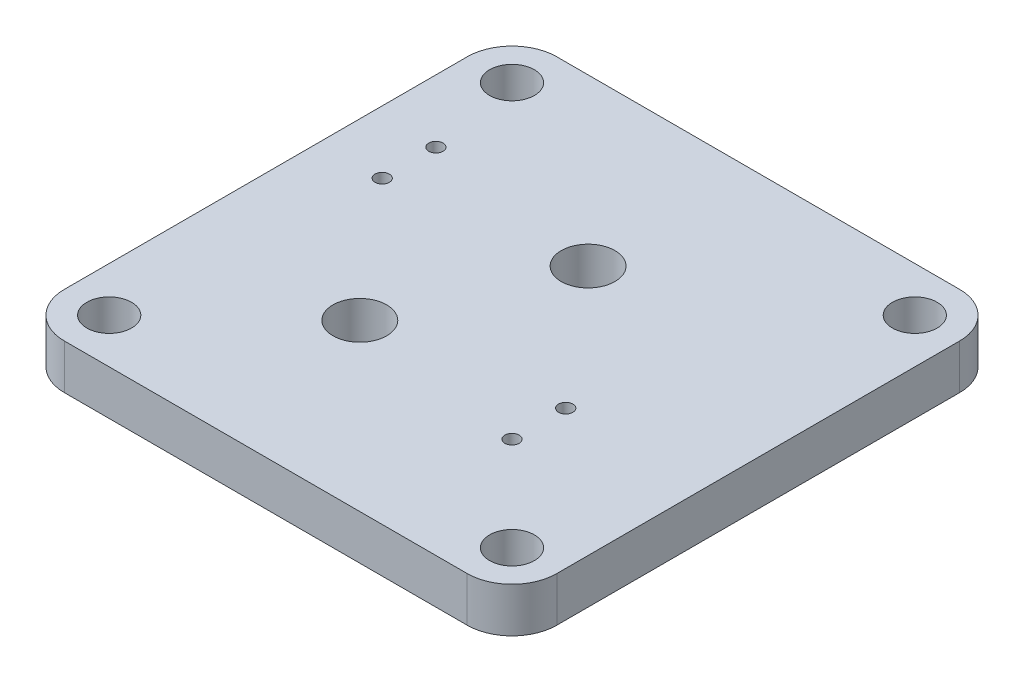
ISO-10303-21;
HEADER;
FILE_DESCRIPTION(('STEP AP214'),'2;1');
FILE_NAME('part.step','',(''),(''),'','','');
FILE_SCHEMA(('AUTOMOTIVE_DESIGN { 1 0 10303 214 1 1 1 1 }'));
ENDSEC;
DATA;
#1=APPLICATION_CONTEXT('core data for automotive mechanical design processes');
#2=APPLICATION_PROTOCOL_DEFINITION('international standard','automotive_design',2000,#1);
#3=PRODUCT_CONTEXT('',#1,'mechanical');
#4=PRODUCT('Part','Part','',(#3));
#5=PRODUCT_RELATED_PRODUCT_CATEGORY('part','',(#4));
#6=PRODUCT_DEFINITION_FORMATION('','',#4);
#7=PRODUCT_DEFINITION_CONTEXT('part definition',#1,'design');
#8=PRODUCT_DEFINITION('design','',#6,#7);
#9=PRODUCT_DEFINITION_SHAPE('','',#8);
#10=(LENGTH_UNIT() NAMED_UNIT(*) SI_UNIT(.MILLI.,.METRE.));
#11=(NAMED_UNIT(*) PLANE_ANGLE_UNIT() SI_UNIT($,.RADIAN.));
#12=(NAMED_UNIT(*) SI_UNIT($,.STERADIAN.) SOLID_ANGLE_UNIT());
#13=UNCERTAINTY_MEASURE_WITH_UNIT(LENGTH_MEASURE(1.E-05),#10,'distance_accuracy_value','');
#14=(GEOMETRIC_REPRESENTATION_CONTEXT(3) GLOBAL_UNCERTAINTY_ASSIGNED_CONTEXT((#13)) GLOBAL_UNIT_ASSIGNED_CONTEXT((#10,
#11,#12)) REPRESENTATION_CONTEXT('',''));
#15=CARTESIAN_POINT('',(0.,0.,0.));
#16=DIRECTION('',(0.,0.,1.));
#17=DIRECTION('',(1.,0.,0.));
#18=AXIS2_PLACEMENT_3D('',#15,#16,#17);
#19=CARTESIAN_POINT('',(-27.5,5.,-27.5));
#20=DIRECTION('',(1.,0.,0.));
#21=DIRECTION('',(0.,0.,-1.));
#22=AXIS2_PLACEMENT_3D('',#19,#20,#21);
#23=PLANE('',#22);
#24=DIRECTION('',(0.,0.,1.));
#25=VECTOR('',#24,1.);
#26=CARTESIAN_POINT('',(-27.5,5.,-27.5));
#27=LINE('',#26,#25);
#28=CARTESIAN_POINT('',(-27.5,5.,-22.5));
#29=VERTEX_POINT('',#28);
#30=CARTESIAN_POINT('',(-27.5,5.,22.5));
#31=VERTEX_POINT('',#30);
#32=EDGE_CURVE('E113',#29,#31,#27,.T.);
#33=ORIENTED_EDGE('',*,*,#32,.F.);
#34=DIRECTION('',(0.,-1.,0.));
#35=VECTOR('',#34,1.);
#36=CARTESIAN_POINT('',(-27.5,5.,-22.5));
#37=LINE('',#36,#35);
#38=CARTESIAN_POINT('',(-27.5,0.,-22.5));
#39=VERTEX_POINT('',#38);
#40=EDGE_CURVE('E98',#29,#39,#37,.T.);
#41=ORIENTED_EDGE('',*,*,#40,.T.);
#42=DIRECTION('',(0.,0.,1.));
#43=VECTOR('',#42,1.);
#44=CARTESIAN_POINT('',(-27.5,0.,-27.5));
#45=LINE('',#44,#43);
#46=CARTESIAN_POINT('',(-27.5,0.,22.5));
#47=VERTEX_POINT('',#46);
#48=EDGE_CURVE('E110',#39,#47,#45,.T.);
#49=ORIENTED_EDGE('',*,*,#48,.T.);
#50=DIRECTION('',(0.,-1.,0.));
#51=VECTOR('',#50,1.);
#52=CARTESIAN_POINT('',(-27.5,5.,22.5));
#53=LINE('',#52,#51);
#54=EDGE_CURVE('E115',#47,#31,#53,.F.);
#55=ORIENTED_EDGE('',*,*,#54,.T.);
#56=EDGE_LOOP('',(#33,#41,#49,#55));
#57=FACE_BOUND('',#56,.T.);
#58=ADVANCED_FACE('F29',(#57),#23,.F.);
#59=CARTESIAN_POINT('',(-27.5,5.,27.5));
#60=DIRECTION('',(0.,0.,-1.));
#61=DIRECTION('',(-1.,0.,0.));
#62=AXIS2_PLACEMENT_3D('',#59,#60,#61);
#63=PLANE('',#62);
#64=DIRECTION('',(1.,0.,0.));
#65=VECTOR('',#64,1.);
#66=CARTESIAN_POINT('',(-27.5,5.,27.5));
#67=LINE('',#66,#65);
#68=CARTESIAN_POINT('',(-22.5,5.,27.5));
#69=VERTEX_POINT('',#68);
#70=CARTESIAN_POINT('',(22.5,5.,27.5));
#71=VERTEX_POINT('',#70);
#72=EDGE_CURVE('E134',#69,#71,#67,.T.);
#73=ORIENTED_EDGE('',*,*,#72,.F.);
#74=DIRECTION('',(0.,-1.,0.));
#75=VECTOR('',#74,1.);
#76=CARTESIAN_POINT('',(-22.5,5.,27.5));
#77=LINE('',#76,#75);
#78=CARTESIAN_POINT('',(-22.5,0.,27.5));
#79=VERTEX_POINT('',#78);
#80=EDGE_CURVE('E158',#69,#79,#77,.T.);
#81=ORIENTED_EDGE('',*,*,#80,.T.);
#82=DIRECTION('',(1.,0.,0.));
#83=VECTOR('',#82,1.);
#84=CARTESIAN_POINT('',(-27.5,0.,27.5));
#85=LINE('',#84,#83);
#86=CARTESIAN_POINT('',(22.5,0.,27.5));
#87=VERTEX_POINT('',#86);
#88=EDGE_CURVE('E119',#79,#87,#85,.T.);
#89=ORIENTED_EDGE('',*,*,#88,.T.);
#90=DIRECTION('',(0.,-1.,0.));
#91=VECTOR('',#90,1.);
#92=CARTESIAN_POINT('',(22.5,5.,27.5));
#93=LINE('',#92,#91);
#94=EDGE_CURVE('E156',#87,#71,#93,.F.);
#95=ORIENTED_EDGE('',*,*,#94,.T.);
#96=EDGE_LOOP('',(#73,#81,#89,#95));
#97=FACE_BOUND('',#96,.T.);
#98=ADVANCED_FACE('F163',(#97),#63,.F.);
#99=CARTESIAN_POINT('',(27.5,5.,-27.5));
#100=DIRECTION('',(-1.,0.,0.));
#101=DIRECTION('',(0.,0.,1.));
#102=AXIS2_PLACEMENT_3D('',#99,#100,#101);
#103=PLANE('',#102);
#104=DIRECTION('',(0.,0.,-1.));
#105=VECTOR('',#104,1.);
#106=CARTESIAN_POINT('',(27.5,5.,-27.5));
#107=LINE('',#106,#105);
#108=CARTESIAN_POINT('',(27.5,5.,22.5));
#109=VERTEX_POINT('',#108);
#110=CARTESIAN_POINT('',(27.5,5.,-22.5));
#111=VERTEX_POINT('',#110);
#112=EDGE_CURVE('E136',#109,#111,#107,.T.);
#113=ORIENTED_EDGE('',*,*,#112,.F.);
#114=DIRECTION('',(0.,-1.,0.));
#115=VECTOR('',#114,1.);
#116=CARTESIAN_POINT('',(27.5,5.,22.5));
#117=LINE('',#116,#115);
#118=CARTESIAN_POINT('',(27.5,0.,22.5));
#119=VERTEX_POINT('',#118);
#120=EDGE_CURVE('E11',#109,#119,#117,.T.);
#121=ORIENTED_EDGE('',*,*,#120,.T.);
#122=DIRECTION('',(0.,0.,-1.));
#123=VECTOR('',#122,1.);
#124=CARTESIAN_POINT('',(27.5,0.,-27.5));
#125=LINE('',#124,#123);
#126=CARTESIAN_POINT('',(27.5,0.,-22.5));
#127=VERTEX_POINT('',#126);
#128=EDGE_CURVE('E123',#119,#127,#125,.T.);
#129=ORIENTED_EDGE('',*,*,#128,.T.);
#130=DIRECTION('',(0.,-1.,0.));
#131=VECTOR('',#130,1.);
#132=CARTESIAN_POINT('',(27.5,5.,-22.5));
#133=LINE('',#132,#131);
#134=EDGE_CURVE('E36',#127,#111,#133,.F.);
#135=ORIENTED_EDGE('',*,*,#134,.T.);
#136=EDGE_LOOP('',(#113,#121,#129,#135));
#137=FACE_BOUND('',#136,.T.);
#138=ADVANCED_FACE('F171',(#137),#103,.F.);
#139=CARTESIAN_POINT('',(-27.5,5.,-27.5));
#140=DIRECTION('',(0.,0.,1.));
#141=DIRECTION('',(1.,0.,0.));
#142=AXIS2_PLACEMENT_3D('',#139,#140,#141);
#143=PLANE('',#142);
#144=DIRECTION('',(-1.,0.,0.));
#145=VECTOR('',#144,1.);
#146=CARTESIAN_POINT('',(-27.5,0.,-27.5));
#147=LINE('',#146,#145);
#148=CARTESIAN_POINT('',(22.5,0.,-27.5));
#149=VERTEX_POINT('',#148);
#150=CARTESIAN_POINT('',(-22.5,0.,-27.5));
#151=VERTEX_POINT('',#150);
#152=EDGE_CURVE('E131',#149,#151,#147,.T.);
#153=ORIENTED_EDGE('',*,*,#152,.T.);
#154=DIRECTION('',(0.,-1.,0.));
#155=VECTOR('',#154,1.);
#156=CARTESIAN_POINT('',(-22.5,5.,-27.5));
#157=LINE('',#156,#155);
#158=CARTESIAN_POINT('',(-22.5,5.,-27.5));
#159=VERTEX_POINT('',#158);
#160=EDGE_CURVE('E99',#151,#159,#157,.F.);
#161=ORIENTED_EDGE('',*,*,#160,.T.);
#162=DIRECTION('',(-1.,0.,0.));
#163=VECTOR('',#162,1.);
#164=CARTESIAN_POINT('',(-27.5,5.,-27.5));
#165=LINE('',#164,#163);
#166=CARTESIAN_POINT('',(22.5,5.,-27.5));
#167=VERTEX_POINT('',#166);
#168=EDGE_CURVE('E138',#167,#159,#165,.T.);
#169=ORIENTED_EDGE('',*,*,#168,.F.);
#170=DIRECTION('',(0.,-1.,0.));
#171=VECTOR('',#170,1.);
#172=CARTESIAN_POINT('',(22.5,5.,-27.5));
#173=LINE('',#172,#171);
#174=EDGE_CURVE('E104',#167,#149,#173,.T.);
#175=ORIENTED_EDGE('',*,*,#174,.T.);
#176=EDGE_LOOP('',(#153,#161,#169,#175));
#177=FACE_BOUND('',#176,.T.);
#178=ADVANCED_FACE('F179',(#177),#143,.F.);
#179=CARTESIAN_POINT('',(-27.5,5.,27.5));
#180=DIRECTION('',(0.,1.,0.));
#181=DIRECTION('',(0.,0.,1.));
#182=AXIS2_PLACEMENT_3D('',#179,#180,#181);
#183=PLANE('',#182);
#184=CARTESIAN_POINT('',(12.,5.,12.));
#185=DIRECTION('',(0.,1.,0.));
#186=DIRECTION('',(0.,0.,-1.));
#187=AXIS2_PLACEMENT_3D('',#184,#185,#186);
#188=CIRCLE('',#187,0.800000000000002);
#189=CARTESIAN_POINT('',(12.,5.,11.2));
#190=VERTEX_POINT('',#189);
#191=EDGE_CURVE('E287',#190,#190,#188,.T.);
#192=ORIENTED_EDGE('',*,*,#191,.F.);
#193=EDGE_LOOP('',(#192));
#194=FACE_BOUND('',#193,.T.);
#195=CARTESIAN_POINT('',(12.,5.,6.));
#196=DIRECTION('',(0.,1.,0.));
#197=DIRECTION('',(0.,0.,1.));
#198=AXIS2_PLACEMENT_3D('',#195,#196,#197);
#199=CIRCLE('',#198,0.800000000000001);
#200=CARTESIAN_POINT('',(12.,5.,6.8));
#201=VERTEX_POINT('',#200);
#202=EDGE_CURVE('E283',#201,#201,#199,.T.);
#203=ORIENTED_EDGE('',*,*,#202,.F.);
#204=EDGE_LOOP('',(#203));
#205=FACE_BOUND('',#204,.T.);
#206=CARTESIAN_POINT('',(-20.5,5.,-6.));
#207=DIRECTION('',(0.,1.,0.));
#208=DIRECTION('',(0.,0.,-1.));
#209=AXIS2_PLACEMENT_3D('',#206,#207,#208);
#210=CIRCLE('',#209,0.799999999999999);
#211=CARTESIAN_POINT('',(-20.5,5.,-6.8));
#212=VERTEX_POINT('',#211);
#213=EDGE_CURVE('E279',#212,#212,#210,.T.);
#214=ORIENTED_EDGE('',*,*,#213,.F.);
#215=EDGE_LOOP('',(#214));
#216=FACE_BOUND('',#215,.T.);
#217=CARTESIAN_POINT('',(-20.5,5.,-12.));
#218=DIRECTION('',(0.,1.,0.));
#219=DIRECTION('',(0.,0.,1.));
#220=AXIS2_PLACEMENT_3D('',#217,#218,#219);
#221=CIRCLE('',#220,0.799999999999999);
#222=CARTESIAN_POINT('',(-20.5,5.,-11.2));
#223=VERTEX_POINT('',#222);
#224=EDGE_CURVE('E275',#223,#223,#221,.T.);
#225=ORIENTED_EDGE('',*,*,#224,.F.);
#226=EDGE_LOOP('',(#225));
#227=FACE_BOUND('',#226,.T.);
#228=CARTESIAN_POINT('',(-0.5,5.,-9.));
#229=DIRECTION('',(0.,1.,0.));
#230=DIRECTION('',(0.,0.,1.));
#231=AXIS2_PLACEMENT_3D('',#228,#229,#230);
#232=CIRCLE('',#231,3.);
#233=CARTESIAN_POINT('',(-0.5,5.,-6.));
#234=VERTEX_POINT('',#233);
#235=EDGE_CURVE('E271',#234,#234,#232,.T.);
#236=ORIENTED_EDGE('',*,*,#235,.F.);
#237=EDGE_LOOP('',(#236));
#238=FACE_BOUND('',#237,.T.);
#239=CARTESIAN_POINT('',(-8.,5.,9.));
#240=DIRECTION('',(0.,1.,0.));
#241=DIRECTION('',(0.,0.,1.));
#242=AXIS2_PLACEMENT_3D('',#239,#240,#241);
#243=CIRCLE('',#242,3.);
#244=CARTESIAN_POINT('',(-8.,5.,12.));
#245=VERTEX_POINT('',#244);
#246=EDGE_CURVE('E267',#245,#245,#243,.T.);
#247=ORIENTED_EDGE('',*,*,#246,.F.);
#248=EDGE_LOOP('',(#247));
#249=FACE_BOUND('',#248,.T.);
#250=CARTESIAN_POINT('',(-22.5,5.,22.5));
#251=DIRECTION('',(0.,1.,0.));
#252=DIRECTION('',(0.,0.,-1.));
#253=AXIS2_PLACEMENT_3D('',#250,#251,#252);
#254=CIRCLE('',#253,2.5);
#255=CARTESIAN_POINT('',(-22.5,5.,20.));
#256=VERTEX_POINT('',#255);
#257=EDGE_CURVE('E263',#256,#256,#254,.T.);
#258=ORIENTED_EDGE('',*,*,#257,.F.);
#259=EDGE_LOOP('',(#258));
#260=FACE_BOUND('',#259,.T.);
#261=CARTESIAN_POINT('',(22.5,5.,22.5));
#262=DIRECTION('',(0.,1.,0.));
#263=DIRECTION('',(0.,0.,1.));
#264=AXIS2_PLACEMENT_3D('',#261,#262,#263);
#265=CIRCLE('',#264,2.5);
#266=CARTESIAN_POINT('',(22.5,5.,25.));
#267=VERTEX_POINT('',#266);
#268=EDGE_CURVE('E259',#267,#267,#265,.T.);
#269=ORIENTED_EDGE('',*,*,#268,.F.);
#270=EDGE_LOOP('',(#269));
#271=FACE_BOUND('',#270,.T.);
#272=CARTESIAN_POINT('',(22.5,5.,-22.5));
#273=DIRECTION('',(0.,1.,0.));
#274=DIRECTION('',(0.,0.,-1.));
#275=AXIS2_PLACEMENT_3D('',#272,#273,#274);
#276=CIRCLE('',#275,2.5);
#277=CARTESIAN_POINT('',(22.5,5.,-25.));
#278=VERTEX_POINT('',#277);
#279=EDGE_CURVE('E253',#278,#278,#276,.T.);
#280=ORIENTED_EDGE('',*,*,#279,.F.);
#281=EDGE_LOOP('',(#280));
#282=FACE_BOUND('',#281,.T.);
#283=CARTESIAN_POINT('',(-22.5,5.,-22.5));
#284=DIRECTION('',(0.,1.,0.));
#285=DIRECTION('',(0.,0.,1.));
#286=AXIS2_PLACEMENT_3D('',#283,#284,#285);
#287=CIRCLE('',#286,2.5);
#288=CARTESIAN_POINT('',(-22.5,5.,-20.));
#289=VERTEX_POINT('',#288);
#290=EDGE_CURVE('E126',#289,#289,#287,.T.);
#291=ORIENTED_EDGE('',*,*,#290,.F.);
#292=EDGE_LOOP('',(#291));
#293=FACE_BOUND('',#292,.T.);
#294=ORIENTED_EDGE('',*,*,#168,.T.);
#295=CARTESIAN_POINT('',(-22.5,5.,-22.5));
#296=DIRECTION('',(0.,1.,0.));
#297=DIRECTION('',(0.,0.,1.));
#298=AXIS2_PLACEMENT_3D('',#295,#296,#297);
#299=CIRCLE('',#298,5.);
#300=EDGE_CURVE('E154',#159,#29,#299,.T.);
#301=ORIENTED_EDGE('',*,*,#300,.T.);
#302=ORIENTED_EDGE('',*,*,#32,.T.);
#303=CARTESIAN_POINT('',(-22.5,5.,22.5));
#304=DIRECTION('',(0.,1.,0.));
#305=DIRECTION('',(0.,0.,1.));
#306=AXIS2_PLACEMENT_3D('',#303,#304,#305);
#307=CIRCLE('',#306,5.);
#308=EDGE_CURVE('E152',#31,#69,#307,.T.);
#309=ORIENTED_EDGE('',*,*,#308,.T.);
#310=ORIENTED_EDGE('',*,*,#72,.T.);
#311=CARTESIAN_POINT('',(22.5,5.,22.5));
#312=DIRECTION('',(0.,1.,0.));
#313=DIRECTION('',(0.,0.,1.));
#314=AXIS2_PLACEMENT_3D('',#311,#312,#313);
#315=CIRCLE('',#314,5.);
#316=EDGE_CURVE('E49',#71,#109,#315,.T.);
#317=ORIENTED_EDGE('',*,*,#316,.T.);
#318=ORIENTED_EDGE('',*,*,#112,.T.);
#319=CARTESIAN_POINT('',(22.5,5.,-22.5));
#320=DIRECTION('',(0.,1.,0.));
#321=DIRECTION('',(0.,0.,1.));
#322=AXIS2_PLACEMENT_3D('',#319,#320,#321);
#323=CIRCLE('',#322,5.);
#324=EDGE_CURVE('E149',#111,#167,#323,.T.);
#325=ORIENTED_EDGE('',*,*,#324,.T.);
#326=EDGE_LOOP('',(#294,#301,#302,#309,#310,#317,#318,#325));
#327=FACE_BOUND('',#326,.T.);
#328=ADVANCED_FACE('F173',(#194,#205,#216,#227,#238,#249,#260,#271,#282,#293,#327),#183,.T.);
#329=CARTESIAN_POINT('',(-27.5,0.,27.5));
#330=DIRECTION('',(0.,1.,0.));
#331=DIRECTION('',(0.,0.,1.));
#332=AXIS2_PLACEMENT_3D('',#329,#330,#331);
#333=PLANE('',#332);
#334=CARTESIAN_POINT('',(12.,0.,12.));
#335=DIRECTION('',(0.,1.,0.));
#336=DIRECTION('',(0.,0.,-1.));
#337=AXIS2_PLACEMENT_3D('',#334,#335,#336);
#338=CIRCLE('',#337,0.800000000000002);
#339=CARTESIAN_POINT('',(12.,0.,11.2));
#340=VERTEX_POINT('',#339);
#341=EDGE_CURVE('E210',#340,#340,#338,.T.);
#342=ORIENTED_EDGE('',*,*,#341,.T.);
#343=EDGE_LOOP('',(#342));
#344=FACE_BOUND('',#343,.T.);
#345=CARTESIAN_POINT('',(12.,0.,6.));
#346=DIRECTION('',(0.,1.,0.));
#347=DIRECTION('',(0.,0.,1.));
#348=AXIS2_PLACEMENT_3D('',#345,#346,#347);
#349=CIRCLE('',#348,0.800000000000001);
#350=CARTESIAN_POINT('',(12.,0.,6.8));
#351=VERTEX_POINT('',#350);
#352=EDGE_CURVE('E214',#351,#351,#349,.T.);
#353=ORIENTED_EDGE('',*,*,#352,.T.);
#354=EDGE_LOOP('',(#353));
#355=FACE_BOUND('',#354,.T.);
#356=CARTESIAN_POINT('',(-20.5,0.,-6.));
#357=DIRECTION('',(0.,1.,0.));
#358=DIRECTION('',(0.,0.,-1.));
#359=AXIS2_PLACEMENT_3D('',#356,#357,#358);
#360=CIRCLE('',#359,0.799999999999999);
#361=CARTESIAN_POINT('',(-20.5,0.,-6.8));
#362=VERTEX_POINT('',#361);
#363=EDGE_CURVE('E218',#362,#362,#360,.T.);
#364=ORIENTED_EDGE('',*,*,#363,.T.);
#365=EDGE_LOOP('',(#364));
#366=FACE_BOUND('',#365,.T.);
#367=CARTESIAN_POINT('',(-20.5,0.,-12.));
#368=DIRECTION('',(0.,1.,0.));
#369=DIRECTION('',(0.,0.,1.));
#370=AXIS2_PLACEMENT_3D('',#367,#368,#369);
#371=CIRCLE('',#370,0.799999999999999);
#372=CARTESIAN_POINT('',(-20.5,0.,-11.2));
#373=VERTEX_POINT('',#372);
#374=EDGE_CURVE('E222',#373,#373,#371,.T.);
#375=ORIENTED_EDGE('',*,*,#374,.T.);
#376=EDGE_LOOP('',(#375));
#377=FACE_BOUND('',#376,.T.);
#378=CARTESIAN_POINT('',(-0.5,0.,-9.));
#379=DIRECTION('',(0.,1.,0.));
#380=DIRECTION('',(0.,0.,1.));
#381=AXIS2_PLACEMENT_3D('',#378,#379,#380);
#382=CIRCLE('',#381,3.);
#383=CARTESIAN_POINT('',(-0.5,0.,-6.));
#384=VERTEX_POINT('',#383);
#385=EDGE_CURVE('E226',#384,#384,#382,.T.);
#386=ORIENTED_EDGE('',*,*,#385,.T.);
#387=EDGE_LOOP('',(#386));
#388=FACE_BOUND('',#387,.T.);
#389=CARTESIAN_POINT('',(-8.,0.,9.));
#390=DIRECTION('',(0.,1.,0.));
#391=DIRECTION('',(0.,0.,1.));
#392=AXIS2_PLACEMENT_3D('',#389,#390,#391);
#393=CIRCLE('',#392,3.);
#394=CARTESIAN_POINT('',(-8.,0.,12.));
#395=VERTEX_POINT('',#394);
#396=EDGE_CURVE('E230',#395,#395,#393,.T.);
#397=ORIENTED_EDGE('',*,*,#396,.T.);
#398=EDGE_LOOP('',(#397));
#399=FACE_BOUND('',#398,.T.);
#400=CARTESIAN_POINT('',(-22.5,0.,22.5));
#401=DIRECTION('',(0.,1.,0.));
#402=DIRECTION('',(0.,0.,-1.));
#403=AXIS2_PLACEMENT_3D('',#400,#401,#402);
#404=CIRCLE('',#403,2.5);
#405=CARTESIAN_POINT('',(-22.5,0.,20.));
#406=VERTEX_POINT('',#405);
#407=EDGE_CURVE('E234',#406,#406,#404,.T.);
#408=ORIENTED_EDGE('',*,*,#407,.T.);
#409=EDGE_LOOP('',(#408));
#410=FACE_BOUND('',#409,.T.);
#411=CARTESIAN_POINT('',(22.5,0.,22.5));
#412=DIRECTION('',(0.,1.,0.));
#413=DIRECTION('',(0.,0.,1.));
#414=AXIS2_PLACEMENT_3D('',#411,#412,#413);
#415=CIRCLE('',#414,2.5);
#416=CARTESIAN_POINT('',(22.5,0.,25.));
#417=VERTEX_POINT('',#416);
#418=EDGE_CURVE('E238',#417,#417,#415,.T.);
#419=ORIENTED_EDGE('',*,*,#418,.T.);
#420=EDGE_LOOP('',(#419));
#421=FACE_BOUND('',#420,.T.);
#422=CARTESIAN_POINT('',(22.5,0.,-22.5));
#423=DIRECTION('',(0.,1.,0.));
#424=DIRECTION('',(0.,0.,-1.));
#425=AXIS2_PLACEMENT_3D('',#422,#423,#424);
#426=CIRCLE('',#425,2.5);
#427=CARTESIAN_POINT('',(22.5,0.,-25.));
#428=VERTEX_POINT('',#427);
#429=EDGE_CURVE('E242',#428,#428,#426,.T.);
#430=ORIENTED_EDGE('',*,*,#429,.T.);
#431=EDGE_LOOP('',(#430));
#432=FACE_BOUND('',#431,.T.);
#433=CARTESIAN_POINT('',(-22.5,0.,-22.5));
#434=DIRECTION('',(0.,1.,0.));
#435=DIRECTION('',(0.,0.,1.));
#436=AXIS2_PLACEMENT_3D('',#433,#434,#435);
#437=CIRCLE('',#436,2.5);
#438=CARTESIAN_POINT('',(-22.5,0.,-20.));
#439=VERTEX_POINT('',#438);
#440=EDGE_CURVE('E120',#439,#439,#437,.T.);
#441=ORIENTED_EDGE('',*,*,#440,.T.);
#442=EDGE_LOOP('',(#441));
#443=FACE_BOUND('',#442,.T.);
#444=ORIENTED_EDGE('',*,*,#48,.F.);
#445=CARTESIAN_POINT('',(-22.5,0.,-22.5));
#446=DIRECTION('',(0.,1.,0.));
#447=DIRECTION('',(0.,0.,1.));
#448=AXIS2_PLACEMENT_3D('',#445,#446,#447);
#449=CIRCLE('',#448,5.);
#450=EDGE_CURVE('E94',#39,#151,#449,.F.);
#451=ORIENTED_EDGE('',*,*,#450,.T.);
#452=ORIENTED_EDGE('',*,*,#152,.F.);
#453=CARTESIAN_POINT('',(22.5,0.,-22.5));
#454=DIRECTION('',(0.,1.,0.));
#455=DIRECTION('',(0.,0.,1.));
#456=AXIS2_PLACEMENT_3D('',#453,#454,#455);
#457=CIRCLE('',#456,5.);
#458=EDGE_CURVE('E114',#149,#127,#457,.F.);
#459=ORIENTED_EDGE('',*,*,#458,.T.);
#460=ORIENTED_EDGE('',*,*,#128,.F.);
#461=CARTESIAN_POINT('',(22.5,0.,22.5));
#462=DIRECTION('',(0.,1.,0.));
#463=DIRECTION('',(0.,0.,1.));
#464=AXIS2_PLACEMENT_3D('',#461,#462,#463);
#465=CIRCLE('',#464,5.);
#466=EDGE_CURVE('E143',#119,#87,#465,.F.);
#467=ORIENTED_EDGE('',*,*,#466,.T.);
#468=ORIENTED_EDGE('',*,*,#88,.F.);
#469=CARTESIAN_POINT('',(-22.5,0.,22.5));
#470=DIRECTION('',(0.,1.,0.));
#471=DIRECTION('',(0.,0.,1.));
#472=AXIS2_PLACEMENT_3D('',#469,#470,#471);
#473=CIRCLE('',#472,5.);
#474=EDGE_CURVE('E105',#79,#47,#473,.F.);
#475=ORIENTED_EDGE('',*,*,#474,.T.);
#476=EDGE_LOOP('',(#444,#451,#452,#459,#460,#467,#468,#475));
#477=FACE_BOUND('',#476,.T.);
#478=ADVANCED_FACE('F117',(#344,#355,#366,#377,#388,#399,#410,#421,#432,#443,#477),#333,.F.);
#479=CARTESIAN_POINT('',(-22.5,5.,-22.5));
#480=DIRECTION('',(0.,-1.,0.));
#481=DIRECTION('',(0.,0.,-1.));
#482=AXIS2_PLACEMENT_3D('',#479,#480,#481);
#483=CYLINDRICAL_SURFACE('',#482,5.);
#484=ORIENTED_EDGE('',*,*,#300,.F.);
#485=ORIENTED_EDGE('',*,*,#160,.F.);
#486=ORIENTED_EDGE('',*,*,#450,.F.);
#487=ORIENTED_EDGE('',*,*,#40,.F.);
#488=EDGE_LOOP('',(#484,#485,#486,#487));
#489=FACE_BOUND('',#488,.T.);
#490=ADVANCED_FACE('F97',(#489),#483,.T.);
#491=CARTESIAN_POINT('',(-22.5,5.,22.5));
#492=DIRECTION('',(0.,-1.,0.));
#493=DIRECTION('',(0.,0.,-1.));
#494=AXIS2_PLACEMENT_3D('',#491,#492,#493);
#495=CYLINDRICAL_SURFACE('',#494,5.);
#496=ORIENTED_EDGE('',*,*,#308,.F.);
#497=ORIENTED_EDGE('',*,*,#54,.F.);
#498=ORIENTED_EDGE('',*,*,#474,.F.);
#499=ORIENTED_EDGE('',*,*,#80,.F.);
#500=EDGE_LOOP('',(#496,#497,#498,#499));
#501=FACE_BOUND('',#500,.T.);
#502=ADVANCED_FACE('F180',(#501),#495,.T.);
#503=CARTESIAN_POINT('',(22.5,5.,22.5));
#504=DIRECTION('',(0.,-1.,0.));
#505=DIRECTION('',(0.,0.,-1.));
#506=AXIS2_PLACEMENT_3D('',#503,#504,#505);
#507=CYLINDRICAL_SURFACE('',#506,5.);
#508=ORIENTED_EDGE('',*,*,#316,.F.);
#509=ORIENTED_EDGE('',*,*,#94,.F.);
#510=ORIENTED_EDGE('',*,*,#466,.F.);
#511=ORIENTED_EDGE('',*,*,#120,.F.);
#512=EDGE_LOOP('',(#508,#509,#510,#511));
#513=FACE_BOUND('',#512,.T.);
#514=ADVANCED_FACE('F170',(#513),#507,.T.);
#515=CARTESIAN_POINT('',(22.5,5.,-22.5));
#516=DIRECTION('',(0.,-1.,0.));
#517=DIRECTION('',(0.,0.,-1.));
#518=AXIS2_PLACEMENT_3D('',#515,#516,#517);
#519=CYLINDRICAL_SURFACE('',#518,5.);
#520=ORIENTED_EDGE('',*,*,#324,.F.);
#521=ORIENTED_EDGE('',*,*,#134,.F.);
#522=ORIENTED_EDGE('',*,*,#458,.F.);
#523=ORIENTED_EDGE('',*,*,#174,.F.);
#524=EDGE_LOOP('',(#520,#521,#522,#523));
#525=FACE_BOUND('',#524,.T.);
#526=ADVANCED_FACE('F177',(#525),#519,.T.);
#527=CARTESIAN_POINT('',(-22.5,0.,-22.5));
#528=DIRECTION('',(0.,1.,0.));
#529=DIRECTION('',(0.,0.,1.));
#530=AXIS2_PLACEMENT_3D('',#527,#528,#529);
#531=CYLINDRICAL_SURFACE('',#530,2.5);
#532=ORIENTED_EDGE('',*,*,#440,.F.);
#533=EDGE_LOOP('',(#532));
#534=FACE_BOUND('',#533,.T.);
#535=ORIENTED_EDGE('',*,*,#290,.T.);
#536=EDGE_LOOP('',(#535));
#537=FACE_BOUND('',#536,.T.);
#538=ADVANCED_FACE('F245',(#534,#537),#531,.F.);
#539=CARTESIAN_POINT('',(22.5,0.,-22.5));
#540=DIRECTION('',(0.,1.,0.));
#541=DIRECTION('',(0.,0.,1.));
#542=AXIS2_PLACEMENT_3D('',#539,#540,#541);
#543=CYLINDRICAL_SURFACE('',#542,2.5);
#544=ORIENTED_EDGE('',*,*,#429,.F.);
#545=EDGE_LOOP('',(#544));
#546=FACE_BOUND('',#545,.T.);
#547=ORIENTED_EDGE('',*,*,#279,.T.);
#548=EDGE_LOOP('',(#547));
#549=FACE_BOUND('',#548,.T.);
#550=ADVANCED_FACE('F248',(#546,#549),#543,.F.);
#551=CARTESIAN_POINT('',(22.5,0.,22.5));
#552=DIRECTION('',(0.,1.,0.));
#553=DIRECTION('',(0.,0.,1.));
#554=AXIS2_PLACEMENT_3D('',#551,#552,#553);
#555=CYLINDRICAL_SURFACE('',#554,2.5);
#556=ORIENTED_EDGE('',*,*,#418,.F.);
#557=EDGE_LOOP('',(#556));
#558=FACE_BOUND('',#557,.T.);
#559=ORIENTED_EDGE('',*,*,#268,.T.);
#560=EDGE_LOOP('',(#559));
#561=FACE_BOUND('',#560,.T.);
#562=ADVANCED_FACE('F310',(#558,#561),#555,.F.);
#563=CARTESIAN_POINT('',(-22.5,0.,22.5));
#564=DIRECTION('',(0.,1.,0.));
#565=DIRECTION('',(0.,0.,1.));
#566=AXIS2_PLACEMENT_3D('',#563,#564,#565);
#567=CYLINDRICAL_SURFACE('',#566,2.5);
#568=ORIENTED_EDGE('',*,*,#407,.F.);
#569=EDGE_LOOP('',(#568));
#570=FACE_BOUND('',#569,.T.);
#571=ORIENTED_EDGE('',*,*,#257,.T.);
#572=EDGE_LOOP('',(#571));
#573=FACE_BOUND('',#572,.T.);
#574=ADVANCED_FACE('F316',(#570,#573),#567,.F.);
#575=CARTESIAN_POINT('',(-8.,0.,9.));
#576=DIRECTION('',(0.,1.,0.));
#577=DIRECTION('',(0.,0.,1.));
#578=AXIS2_PLACEMENT_3D('',#575,#576,#577);
#579=CYLINDRICAL_SURFACE('',#578,3.);
#580=ORIENTED_EDGE('',*,*,#396,.F.);
#581=EDGE_LOOP('',(#580));
#582=FACE_BOUND('',#581,.T.);
#583=ORIENTED_EDGE('',*,*,#246,.T.);
#584=EDGE_LOOP('',(#583));
#585=FACE_BOUND('',#584,.T.);
#586=ADVANCED_FACE('F349',(#582,#585),#579,.F.);
#587=CARTESIAN_POINT('',(-0.5,0.,-9.));
#588=DIRECTION('',(0.,1.,0.));
#589=DIRECTION('',(0.,0.,1.));
#590=AXIS2_PLACEMENT_3D('',#587,#588,#589);
#591=CYLINDRICAL_SURFACE('',#590,3.);
#592=ORIENTED_EDGE('',*,*,#385,.F.);
#593=EDGE_LOOP('',(#592));
#594=FACE_BOUND('',#593,.T.);
#595=ORIENTED_EDGE('',*,*,#235,.T.);
#596=EDGE_LOOP('',(#595));
#597=FACE_BOUND('',#596,.T.);
#598=ADVANCED_FACE('F370',(#594,#597),#591,.F.);
#599=CARTESIAN_POINT('',(-20.5,0.,-12.));
#600=DIRECTION('',(0.,1.,0.));
#601=DIRECTION('',(0.,0.,1.));
#602=AXIS2_PLACEMENT_3D('',#599,#600,#601);
#603=CYLINDRICAL_SURFACE('',#602,0.799999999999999);
#604=ORIENTED_EDGE('',*,*,#374,.F.);
#605=EDGE_LOOP('',(#604));
#606=FACE_BOUND('',#605,.T.);
#607=ORIENTED_EDGE('',*,*,#224,.T.);
#608=EDGE_LOOP('',(#607));
#609=FACE_BOUND('',#608,.T.);
#610=ADVANCED_FACE('F380',(#606,#609),#603,.F.);
#611=CARTESIAN_POINT('',(-20.5,0.,-6.));
#612=DIRECTION('',(0.,1.,0.));
#613=DIRECTION('',(0.,0.,1.));
#614=AXIS2_PLACEMENT_3D('',#611,#612,#613);
#615=CYLINDRICAL_SURFACE('',#614,0.799999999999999);
#616=ORIENTED_EDGE('',*,*,#363,.F.);
#617=EDGE_LOOP('',(#616));
#618=FACE_BOUND('',#617,.T.);
#619=ORIENTED_EDGE('',*,*,#213,.T.);
#620=EDGE_LOOP('',(#619));
#621=FACE_BOUND('',#620,.T.);
#622=ADVANCED_FACE('F390',(#618,#621),#615,.F.);
#623=CARTESIAN_POINT('',(12.,0.,6.));
#624=DIRECTION('',(0.,1.,0.));
#625=DIRECTION('',(0.,0.,1.));
#626=AXIS2_PLACEMENT_3D('',#623,#624,#625);
#627=CYLINDRICAL_SURFACE('',#626,0.800000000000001);
#628=ORIENTED_EDGE('',*,*,#352,.F.);
#629=EDGE_LOOP('',(#628));
#630=FACE_BOUND('',#629,.T.);
#631=ORIENTED_EDGE('',*,*,#202,.T.);
#632=EDGE_LOOP('',(#631));
#633=FACE_BOUND('',#632,.T.);
#634=ADVANCED_FACE('F400',(#630,#633),#627,.F.);
#635=CARTESIAN_POINT('',(12.,0.,12.));
#636=DIRECTION('',(0.,1.,0.));
#637=DIRECTION('',(0.,0.,1.));
#638=AXIS2_PLACEMENT_3D('',#635,#636,#637);
#639=CYLINDRICAL_SURFACE('',#638,0.800000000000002);
#640=ORIENTED_EDGE('',*,*,#341,.F.);
#641=EDGE_LOOP('',(#640));
#642=FACE_BOUND('',#641,.T.);
#643=ORIENTED_EDGE('',*,*,#191,.T.);
#644=EDGE_LOOP('',(#643));
#645=FACE_BOUND('',#644,.T.);
#646=ADVANCED_FACE('F291',(#642,#645),#639,.F.);
#647=CLOSED_SHELL('',(#58,#98,#138,#178,#328,#478,#490,#502,#514,#526,#538,#550,#562,#574,#586,
#598,#610,#622,#634,#646));
#648=MANIFOLD_SOLID_BREP('B2',#647);
#649=ADVANCED_BREP_SHAPE_REPRESENTATION('',(#18,#648),#14);
#650=SHAPE_DEFINITION_REPRESENTATION(#9,#649);
ENDSEC;
END-ISO-10303-21;
